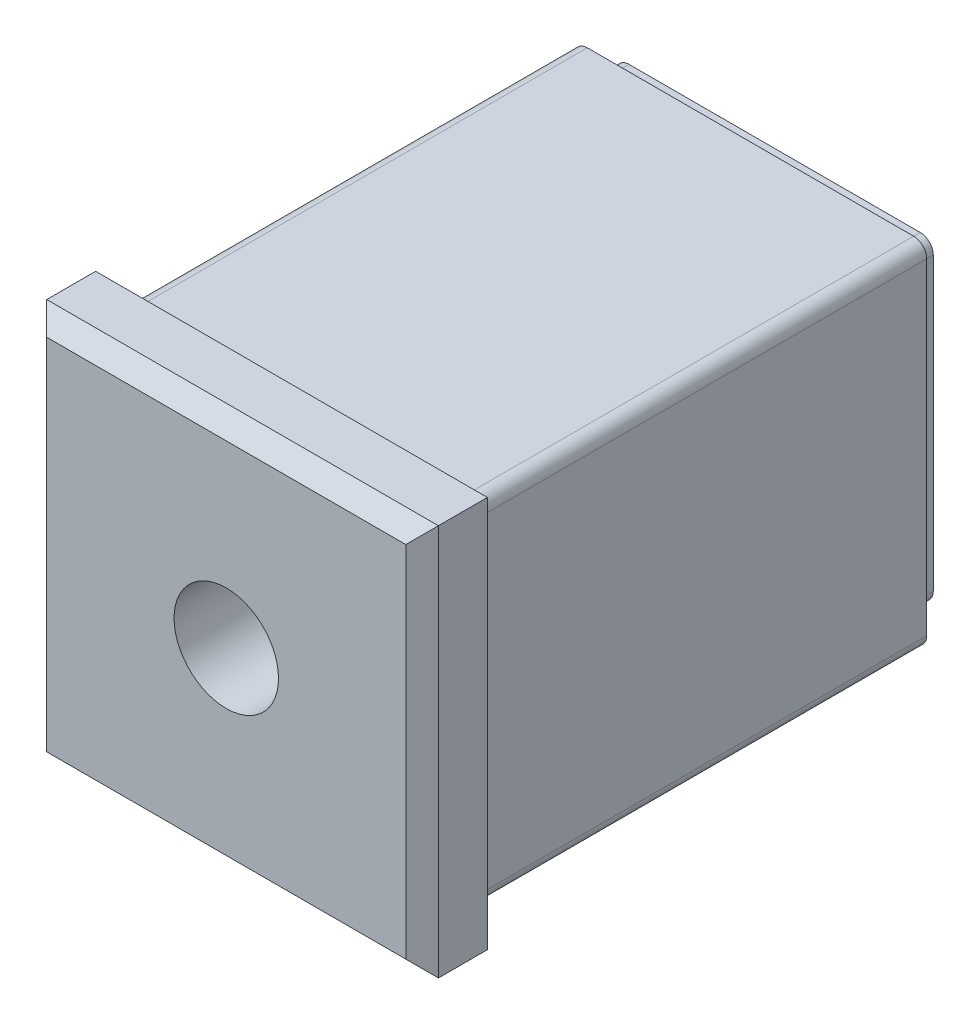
ISO-10303-21;
HEADER;
FILE_DESCRIPTION(('STEP AP214'),'2;1');
FILE_NAME('part.step','',(''),(''),'','','');
FILE_SCHEMA(('AUTOMOTIVE_DESIGN { 1 0 10303 214 1 1 1 1 }'));
ENDSEC;
DATA;
#1=APPLICATION_CONTEXT('core data for automotive mechanical design processes');
#2=APPLICATION_PROTOCOL_DEFINITION('international standard','automotive_design',2000,#1);
#3=PRODUCT_CONTEXT('',#1,'mechanical');
#4=PRODUCT('Part','Part','',(#3));
#5=PRODUCT_RELATED_PRODUCT_CATEGORY('part','',(#4));
#6=PRODUCT_DEFINITION_FORMATION('','',#4);
#7=PRODUCT_DEFINITION_CONTEXT('part definition',#1,'design');
#8=PRODUCT_DEFINITION('design','',#6,#7);
#9=PRODUCT_DEFINITION_SHAPE('','',#8);
#10=(LENGTH_UNIT() NAMED_UNIT(*) SI_UNIT(.MILLI.,.METRE.));
#11=(NAMED_UNIT(*) PLANE_ANGLE_UNIT() SI_UNIT($,.RADIAN.));
#12=(NAMED_UNIT(*) SI_UNIT($,.STERADIAN.) SOLID_ANGLE_UNIT());
#13=UNCERTAINTY_MEASURE_WITH_UNIT(LENGTH_MEASURE(1.E-05),#10,'distance_accuracy_value','');
#14=(GEOMETRIC_REPRESENTATION_CONTEXT(3) GLOBAL_UNCERTAINTY_ASSIGNED_CONTEXT((#13)) GLOBAL_UNIT_ASSIGNED_CONTEXT((#10,
#11,#12)) REPRESENTATION_CONTEXT('',''));
#15=CARTESIAN_POINT('',(0.,0.,0.));
#16=DIRECTION('',(0.,0.,1.));
#17=DIRECTION('',(1.,0.,0.));
#18=AXIS2_PLACEMENT_3D('',#15,#16,#17);
#19=CARTESIAN_POINT('',(13.75,0.,5.));
#20=DIRECTION('',(0.,0.,1.));
#21=DIRECTION('',(0.,1.,0.));
#22=AXIS2_PLACEMENT_3D('',#19,#20,#21);
#23=PLANE('',#22);
#24=DIRECTION('',(0.,-1.,0.));
#25=VECTOR('',#24,1.);
#26=CARTESIAN_POINT('',(-13.75,0.,5.));
#27=LINE('',#26,#25);
#28=CARTESIAN_POINT('',(-13.75,-13.75,5.));
#29=VERTEX_POINT('',#28);
#30=CARTESIAN_POINT('',(-13.75,13.75,5.));
#31=VERTEX_POINT('',#30);
#32=EDGE_CURVE('E237',#29,#31,#27,.F.);
#33=ORIENTED_EDGE('',*,*,#32,.F.);
#34=DIRECTION('',(-1.,0.,0.));
#35=VECTOR('',#34,1.);
#36=CARTESIAN_POINT('',(37.,-13.75,5.));
#37=LINE('',#36,#35);
#38=CARTESIAN_POINT('',(13.75,-13.75,5.));
#39=VERTEX_POINT('',#38);
#40=EDGE_CURVE('E188',#29,#39,#37,.F.);
#41=ORIENTED_EDGE('',*,*,#40,.T.);
#42=DIRECTION('',(0.,-1.,0.));
#43=VECTOR('',#42,1.);
#44=CARTESIAN_POINT('',(13.75,0.,5.));
#45=LINE('',#44,#43);
#46=CARTESIAN_POINT('',(13.75,13.75,5.));
#47=VERTEX_POINT('',#46);
#48=EDGE_CURVE('E347',#47,#39,#45,.T.);
#49=ORIENTED_EDGE('',*,*,#48,.F.);
#50=DIRECTION('',(-1.,0.,0.));
#51=VECTOR('',#50,1.);
#52=CARTESIAN_POINT('',(-30.,13.75,5.));
#53=LINE('',#52,#51);
#54=EDGE_CURVE('E360',#47,#31,#53,.T.);
#55=ORIENTED_EDGE('',*,*,#54,.T.);
#56=EDGE_LOOP('',(#33,#41,#49,#55));
#57=FACE_BOUND('',#56,.T.);
#58=CARTESIAN_POINT('',(0.,0.,5.));
#59=DIRECTION('',(0.,0.,1.));
#60=DIRECTION('',(0.,1.,0.));
#61=AXIS2_PLACEMENT_3D('',#58,#59,#60);
#62=CIRCLE('',#61,4.);
#63=CARTESIAN_POINT('',(0.,4.,5.));
#64=VERTEX_POINT('',#63);
#65=EDGE_CURVE('E191',#64,#64,#62,.F.);
#66=ORIENTED_EDGE('',*,*,#65,.T.);
#67=EDGE_LOOP('',(#66));
#68=FACE_BOUND('',#67,.T.);
#69=ADVANCED_FACE('F14',(#57,#68),#23,.T.);
#70=CARTESIAN_POINT('',(-30.,15.,3.75));
#71=DIRECTION('',(0.,-0.707106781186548,-0.707106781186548));
#72=DIRECTION('',(0.,-0.707106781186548,0.707106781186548));
#73=AXIS2_PLACEMENT_3D('',#70,#71,#72);
#74=PLANE('',#73);
#75=DIRECTION('',(-1.,0.,0.));
#76=VECTOR('',#75,1.);
#77=CARTESIAN_POINT('',(0.,15.,3.75));
#78=LINE('',#77,#76);
#79=CARTESIAN_POINT('',(15.,15.,3.75));
#80=VERTEX_POINT('',#79);
#81=CARTESIAN_POINT('',(-15.,15.,3.75));
#82=VERTEX_POINT('',#81);
#83=EDGE_CURVE('E338',#80,#82,#78,.T.);
#84=ORIENTED_EDGE('',*,*,#83,.T.);
#85=DIRECTION('',(-0.577350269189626,0.577350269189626,-0.577350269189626));
#86=VECTOR('',#85,1.);
#87=CARTESIAN_POINT('',(-13.75,13.75,5.));
#88=LINE('',#87,#86);
#89=EDGE_CURVE('E363',#31,#82,#88,.T.);
#90=ORIENTED_EDGE('',*,*,#89,.F.);
#91=ORIENTED_EDGE('',*,*,#54,.F.);
#92=DIRECTION('',(-0.577350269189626,-0.577350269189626,0.577350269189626));
#93=VECTOR('',#92,1.);
#94=CARTESIAN_POINT('',(15.,15.,3.75));
#95=LINE('',#94,#93);
#96=EDGE_CURVE('E349',#80,#47,#95,.T.);
#97=ORIENTED_EDGE('',*,*,#96,.F.);
#98=EDGE_LOOP('',(#84,#90,#91,#97));
#99=FACE_BOUND('',#98,.T.);
#100=ADVANCED_FACE('F441',(#99),#74,.F.);
#101=CARTESIAN_POINT('',(-13.75,0.,5.));
#102=DIRECTION('',(-0.707106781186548,0.,0.707106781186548));
#103=DIRECTION('',(-0.707106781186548,0.,-0.707106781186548));
#104=AXIS2_PLACEMENT_3D('',#101,#102,#103);
#105=PLANE('',#104);
#106=DIRECTION('',(0.,1.,0.));
#107=VECTOR('',#106,1.);
#108=CARTESIAN_POINT('',(-15.,0.,3.75));
#109=LINE('',#108,#107);
#110=CARTESIAN_POINT('',(-15.,-15.,3.75));
#111=VERTEX_POINT('',#110);
#112=EDGE_CURVE('E18',#111,#82,#109,.T.);
#113=ORIENTED_EDGE('',*,*,#112,.F.);
#114=DIRECTION('',(0.577350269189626,0.577350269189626,0.577350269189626));
#115=VECTOR('',#114,1.);
#116=CARTESIAN_POINT('',(-15.,-15.,3.75));
#117=LINE('',#116,#115);
#118=EDGE_CURVE('E164',#111,#29,#117,.T.);
#119=ORIENTED_EDGE('',*,*,#118,.T.);
#120=ORIENTED_EDGE('',*,*,#32,.T.);
#121=ORIENTED_EDGE('',*,*,#89,.T.);
#122=EDGE_LOOP('',(#113,#119,#120,#121));
#123=FACE_BOUND('',#122,.T.);
#124=ADVANCED_FACE('F443',(#123),#105,.T.);
#125=CARTESIAN_POINT('',(15.,0.,3.75));
#126=DIRECTION('',(0.707106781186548,0.,0.707106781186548));
#127=DIRECTION('',(-0.707106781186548,0.,0.707106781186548));
#128=AXIS2_PLACEMENT_3D('',#125,#126,#127);
#129=PLANE('',#128);
#130=ORIENTED_EDGE('',*,*,#48,.T.);
#131=DIRECTION('',(0.577350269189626,-0.577350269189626,-0.577350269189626));
#132=VECTOR('',#131,1.);
#133=CARTESIAN_POINT('',(13.75,-13.75,5.));
#134=LINE('',#133,#132);
#135=CARTESIAN_POINT('',(15.,-15.,3.75));
#136=VERTEX_POINT('',#135);
#137=EDGE_CURVE('E187',#39,#136,#134,.T.);
#138=ORIENTED_EDGE('',*,*,#137,.T.);
#139=DIRECTION('',(0.,-1.,0.));
#140=VECTOR('',#139,1.);
#141=CARTESIAN_POINT('',(15.,0.,3.75));
#142=LINE('',#141,#140);
#143=EDGE_CURVE('E333',#80,#136,#142,.T.);
#144=ORIENTED_EDGE('',*,*,#143,.F.);
#145=ORIENTED_EDGE('',*,*,#96,.T.);
#146=EDGE_LOOP('',(#130,#138,#144,#145));
#147=FACE_BOUND('',#146,.T.);
#148=ADVANCED_FACE('F446',(#147),#129,.T.);
#149=CARTESIAN_POINT('',(-15.,0.,-37.));
#150=DIRECTION('',(0.,0.,-1.));
#151=DIRECTION('',(0.,-1.,0.));
#152=AXIS2_PLACEMENT_3D('',#149,#150,#151);
#153=PLANE('',#152);
#154=DIRECTION('',(-1.,0.,0.));
#155=VECTOR('',#154,1.);
#156=CARTESIAN_POINT('',(-11.15,12.15,-37.));
#157=LINE('',#156,#155);
#158=CARTESIAN_POINT('',(-11.15,12.15,-37.));
#159=VERTEX_POINT('',#158);
#160=CARTESIAN_POINT('',(11.15,12.15,-37.));
#161=VERTEX_POINT('',#160);
#162=EDGE_CURVE('E322',#159,#161,#157,.F.);
#163=ORIENTED_EDGE('',*,*,#162,.T.);
#164=CARTESIAN_POINT('',(11.15,11.15,-37.));
#165=DIRECTION('',(0.,0.,1.));
#166=DIRECTION('',(0.,1.,0.));
#167=AXIS2_PLACEMENT_3D('',#164,#165,#166);
#168=CIRCLE('',#167,1.);
#169=CARTESIAN_POINT('',(12.15,11.15,-37.));
#170=VERTEX_POINT('',#169);
#171=EDGE_CURVE('E375',#161,#170,#168,.F.);
#172=ORIENTED_EDGE('',*,*,#171,.T.);
#173=DIRECTION('',(0.,1.,0.));
#174=VECTOR('',#173,1.);
#175=CARTESIAN_POINT('',(12.15,11.15,-37.));
#176=LINE('',#175,#174);
#177=CARTESIAN_POINT('',(12.15,-11.15,-37.));
#178=VERTEX_POINT('',#177);
#179=EDGE_CURVE('E327',#170,#178,#176,.F.);
#180=ORIENTED_EDGE('',*,*,#179,.T.);
#181=CARTESIAN_POINT('',(11.15,-11.15,-37.));
#182=DIRECTION('',(0.,0.,1.));
#183=DIRECTION('',(0.,1.,0.));
#184=AXIS2_PLACEMENT_3D('',#181,#182,#183);
#185=CIRCLE('',#184,1.);
#186=CARTESIAN_POINT('',(11.15,-12.15,-37.));
#187=VERTEX_POINT('',#186);
#188=EDGE_CURVE('E211',#178,#187,#185,.F.);
#189=ORIENTED_EDGE('',*,*,#188,.T.);
#190=DIRECTION('',(1.,0.,0.));
#191=VECTOR('',#190,1.);
#192=CARTESIAN_POINT('',(11.15,-12.15,-37.));
#193=LINE('',#192,#191);
#194=CARTESIAN_POINT('',(-11.15,-12.15,-37.));
#195=VERTEX_POINT('',#194);
#196=EDGE_CURVE('E181',#187,#195,#193,.F.);
#197=ORIENTED_EDGE('',*,*,#196,.T.);
#198=CARTESIAN_POINT('',(-11.15,-11.15,-37.));
#199=DIRECTION('',(0.,0.,1.));
#200=DIRECTION('',(0.,1.,0.));
#201=AXIS2_PLACEMENT_3D('',#198,#199,#200);
#202=CIRCLE('',#201,1.);
#203=CARTESIAN_POINT('',(-12.15,-11.15,-37.));
#204=VERTEX_POINT('',#203);
#205=EDGE_CURVE('E193',#195,#204,#202,.F.);
#206=ORIENTED_EDGE('',*,*,#205,.T.);
#207=DIRECTION('',(0.,-1.,0.));
#208=VECTOR('',#207,1.);
#209=CARTESIAN_POINT('',(-12.15,-11.15,-37.));
#210=LINE('',#209,#208);
#211=CARTESIAN_POINT('',(-12.15,11.15,-37.));
#212=VERTEX_POINT('',#211);
#213=EDGE_CURVE('E167',#204,#212,#210,.F.);
#214=ORIENTED_EDGE('',*,*,#213,.T.);
#215=CARTESIAN_POINT('',(-11.15,11.15,-37.));
#216=DIRECTION('',(0.,0.,1.));
#217=DIRECTION('',(0.,1.,0.));
#218=AXIS2_PLACEMENT_3D('',#215,#216,#217);
#219=CIRCLE('',#218,1.);
#220=EDGE_CURVE('E377',#212,#159,#219,.F.);
#221=ORIENTED_EDGE('',*,*,#220,.T.);
#222=EDGE_LOOP('',(#163,#172,#180,#189,#197,#206,#214,#221));
#223=FACE_BOUND('',#222,.T.);
#224=CARTESIAN_POINT('',(0.,0.,-37.));
#225=DIRECTION('',(0.,0.,-1.));
#226=DIRECTION('',(0.,-1.,0.));
#227=AXIS2_PLACEMENT_3D('',#224,#225,#226);
#228=CIRCLE('',#227,4.);
#229=CARTESIAN_POINT('',(0.,-4.,-37.));
#230=VERTEX_POINT('',#229);
#231=EDGE_CURVE('E651',#230,#230,#228,.T.);
#232=ORIENTED_EDGE('',*,*,#231,.F.);
#233=EDGE_LOOP('',(#232));
#234=FACE_BOUND('',#233,.T.);
#235=ADVANCED_FACE('F389',(#223,#234),#153,.T.);
#236=CARTESIAN_POINT('',(15.,0.,-37.));
#237=DIRECTION('',(1.,0.,0.));
#238=DIRECTION('',(0.,-1.,0.));
#239=AXIS2_PLACEMENT_3D('',#236,#237,#238);
#240=PLANE('',#239);
#241=ORIENTED_EDGE('',*,*,#143,.T.);
#242=DIRECTION('',(0.,0.,-1.));
#243=VECTOR('',#242,1.);
#244=CARTESIAN_POINT('',(15.,-15.,5.));
#245=LINE('',#244,#243);
#246=CARTESIAN_POINT('',(15.,-15.,0.));
#247=VERTEX_POINT('',#246);
#248=EDGE_CURVE('E174',#136,#247,#245,.T.);
#249=ORIENTED_EDGE('',*,*,#248,.T.);
#250=DIRECTION('',(0.,-1.,0.));
#251=VECTOR('',#250,1.);
#252=CARTESIAN_POINT('',(15.,0.,0.));
#253=LINE('',#252,#251);
#254=CARTESIAN_POINT('',(15.,15.,0.));
#255=VERTEX_POINT('',#254);
#256=EDGE_CURVE('E309',#255,#247,#253,.T.);
#257=ORIENTED_EDGE('',*,*,#256,.F.);
#258=DIRECTION('',(0.,0.,-1.));
#259=VECTOR('',#258,1.);
#260=CARTESIAN_POINT('',(15.,15.,-37.));
#261=LINE('',#260,#259);
#262=EDGE_CURVE('E337',#255,#80,#261,.F.);
#263=ORIENTED_EDGE('',*,*,#262,.T.);
#264=EDGE_LOOP('',(#241,#249,#257,#263));
#265=FACE_BOUND('',#264,.T.);
#266=ADVANCED_FACE('F467',(#265),#240,.T.);
#267=CARTESIAN_POINT('',(0.,15.,5.));
#268=DIRECTION('',(0.,-1.,0.));
#269=DIRECTION('',(-1.,0.,0.));
#270=AXIS2_PLACEMENT_3D('',#267,#268,#269);
#271=PLANE('',#270);
#272=DIRECTION('',(0.,0.,-1.));
#273=VECTOR('',#272,1.);
#274=CARTESIAN_POINT('',(-15.,15.,5.));
#275=LINE('',#274,#273);
#276=CARTESIAN_POINT('',(-15.,15.,0.));
#277=VERTEX_POINT('',#276);
#278=EDGE_CURVE('E334',#82,#277,#275,.T.);
#279=ORIENTED_EDGE('',*,*,#278,.F.);
#280=ORIENTED_EDGE('',*,*,#83,.F.);
#281=ORIENTED_EDGE('',*,*,#262,.F.);
#282=DIRECTION('',(-1.,0.,0.));
#283=VECTOR('',#282,1.);
#284=CARTESIAN_POINT('',(0.,15.,0.));
#285=LINE('',#284,#283);
#286=EDGE_CURVE('E312',#277,#255,#285,.F.);
#287=ORIENTED_EDGE('',*,*,#286,.F.);
#288=EDGE_LOOP('',(#279,#280,#281,#287));
#289=FACE_BOUND('',#288,.T.);
#290=ADVANCED_FACE('F470',(#289),#271,.F.);
#291=CARTESIAN_POINT('',(-15.,0.,3.75));
#292=DIRECTION('',(-1.,0.,0.));
#293=DIRECTION('',(0.,1.,0.));
#294=AXIS2_PLACEMENT_3D('',#291,#292,#293);
#295=PLANE('',#294);
#296=ORIENTED_EDGE('',*,*,#112,.T.);
#297=ORIENTED_EDGE('',*,*,#278,.T.);
#298=DIRECTION('',(0.,-1.,0.));
#299=VECTOR('',#298,1.);
#300=CARTESIAN_POINT('',(-15.,0.,0.));
#301=LINE('',#300,#299);
#302=CARTESIAN_POINT('',(-15.,-15.,0.));
#303=VERTEX_POINT('',#302);
#304=EDGE_CURVE('E315',#303,#277,#301,.F.);
#305=ORIENTED_EDGE('',*,*,#304,.F.);
#306=DIRECTION('',(0.,0.,-1.));
#307=VECTOR('',#306,1.);
#308=CARTESIAN_POINT('',(-15.,-15.,-37.));
#309=LINE('',#308,#307);
#310=EDGE_CURVE('E169',#303,#111,#309,.F.);
#311=ORIENTED_EDGE('',*,*,#310,.T.);
#312=EDGE_LOOP('',(#296,#297,#305,#311));
#313=FACE_BOUND('',#312,.T.);
#314=ADVANCED_FACE('F474',(#313),#295,.T.);
#315=CARTESIAN_POINT('',(-12.5,13.5,0.));
#316=DIRECTION('',(0.,-1.,0.));
#317=DIRECTION('',(-1.,0.,0.));
#318=AXIS2_PLACEMENT_3D('',#315,#316,#317);
#319=PLANE('',#318);
#320=DIRECTION('',(0.,0.,-1.));
#321=VECTOR('',#320,1.);
#322=CARTESIAN_POINT('',(-12.5,13.5,0.));
#323=LINE('',#322,#321);
#324=CARTESIAN_POINT('',(-12.5,13.5,0.));
#325=VERTEX_POINT('',#324);
#326=CARTESIAN_POINT('',(-12.5,13.5,-35.15));
#327=VERTEX_POINT('',#326);
#328=EDGE_CURVE('E24',#325,#327,#323,.T.);
#329=ORIENTED_EDGE('',*,*,#328,.F.);
#330=DIRECTION('',(-1.,0.,0.));
#331=VECTOR('',#330,1.);
#332=CARTESIAN_POINT('',(-12.5,13.5,0.));
#333=LINE('',#332,#331);
#334=CARTESIAN_POINT('',(12.5,13.5,0.));
#335=VERTEX_POINT('',#334);
#336=EDGE_CURVE('E279',#335,#325,#333,.T.);
#337=ORIENTED_EDGE('',*,*,#336,.F.);
#338=DIRECTION('',(0.,0.,-1.));
#339=VECTOR('',#338,1.);
#340=CARTESIAN_POINT('',(12.5,13.5,0.));
#341=LINE('',#340,#339);
#342=CARTESIAN_POINT('',(12.5,13.5,-35.15));
#343=VERTEX_POINT('',#342);
#344=EDGE_CURVE('E276',#343,#335,#341,.F.);
#345=ORIENTED_EDGE('',*,*,#344,.F.);
#346=DIRECTION('',(-1.,0.,0.));
#347=VECTOR('',#346,1.);
#348=CARTESIAN_POINT('',(-12.5,13.5,-35.15));
#349=LINE('',#348,#347);
#350=EDGE_CURVE('E9',#327,#343,#349,.F.);
#351=ORIENTED_EDGE('',*,*,#350,.F.);
#352=EDGE_LOOP('',(#329,#337,#345,#351));
#353=FACE_BOUND('',#352,.T.);
#354=ADVANCED_FACE('F477',(#353),#319,.F.);
#355=CARTESIAN_POINT('',(-12.5,12.5,0.));
#356=DIRECTION('',(0.,0.,1.));
#357=DIRECTION('',(0.,1.,0.));
#358=AXIS2_PLACEMENT_3D('',#355,#356,#357);
#359=CYLINDRICAL_SURFACE('',#358,1.);
#360=CARTESIAN_POINT('',(-12.5,12.5,0.));
#361=DIRECTION('',(0.,0.,1.));
#362=DIRECTION('',(0.,1.,0.));
#363=AXIS2_PLACEMENT_3D('',#360,#361,#362);
#364=CIRCLE('',#363,1.);
#365=CARTESIAN_POINT('',(-13.5,12.5,0.));
#366=VERTEX_POINT('',#365);
#367=EDGE_CURVE('E295',#366,#325,#364,.F.);
#368=ORIENTED_EDGE('',*,*,#367,.T.);
#369=ORIENTED_EDGE('',*,*,#328,.T.);
#370=CARTESIAN_POINT('',(-12.5,12.5,-35.15));
#371=DIRECTION('',(0.,0.,1.));
#372=DIRECTION('',(0.,1.,0.));
#373=AXIS2_PLACEMENT_3D('',#370,#371,#372);
#374=CIRCLE('',#373,1.);
#375=CARTESIAN_POINT('',(-13.5,12.5,-35.15));
#376=VERTEX_POINT('',#375);
#377=EDGE_CURVE('E32',#376,#327,#374,.F.);
#378=ORIENTED_EDGE('',*,*,#377,.F.);
#379=DIRECTION('',(0.,0.,1.));
#380=VECTOR('',#379,1.);
#381=CARTESIAN_POINT('',(-13.5,12.5,0.));
#382=LINE('',#381,#380);
#383=EDGE_CURVE('E304',#376,#366,#382,.T.);
#384=ORIENTED_EDGE('',*,*,#383,.T.);
#385=EDGE_LOOP('',(#368,#369,#378,#384));
#386=FACE_BOUND('',#385,.T.);
#387=ADVANCED_FACE('F512',(#386),#359,.T.);
#388=CARTESIAN_POINT('',(-13.5,-12.5,0.));
#389=DIRECTION('',(1.,0.,0.));
#390=DIRECTION('',(0.,-1.,0.));
#391=AXIS2_PLACEMENT_3D('',#388,#389,#390);
#392=PLANE('',#391);
#393=DIRECTION('',(0.,-1.,0.));
#394=VECTOR('',#393,1.);
#395=CARTESIAN_POINT('',(-13.5,0.,-35.15));
#396=LINE('',#395,#394);
#397=CARTESIAN_POINT('',(-13.5,-12.5,-35.15));
#398=VERTEX_POINT('',#397);
#399=EDGE_CURVE('E153',#398,#376,#396,.F.);
#400=ORIENTED_EDGE('',*,*,#399,.F.);
#401=DIRECTION('',(0.,0.,1.));
#402=VECTOR('',#401,1.);
#403=CARTESIAN_POINT('',(-13.5,-12.5,0.));
#404=LINE('',#403,#402);
#405=CARTESIAN_POINT('',(-13.5,-12.5,0.));
#406=VERTEX_POINT('',#405);
#407=EDGE_CURVE('E244',#406,#398,#404,.F.);
#408=ORIENTED_EDGE('',*,*,#407,.F.);
#409=DIRECTION('',(0.,-1.,0.));
#410=VECTOR('',#409,1.);
#411=CARTESIAN_POINT('',(-13.5,0.,0.));
#412=LINE('',#411,#410);
#413=EDGE_CURVE('E302',#366,#406,#412,.T.);
#414=ORIENTED_EDGE('',*,*,#413,.F.);
#415=ORIENTED_EDGE('',*,*,#383,.F.);
#416=EDGE_LOOP('',(#400,#408,#414,#415));
#417=FACE_BOUND('',#416,.T.);
#418=ADVANCED_FACE('F405',(#417),#392,.F.);
#419=CARTESIAN_POINT('',(-12.15,-11.15,-35.15));
#420=DIRECTION('',(1.,0.,0.));
#421=DIRECTION('',(0.,-1.,0.));
#422=AXIS2_PLACEMENT_3D('',#419,#420,#421);
#423=PLANE('',#422);
#424=ORIENTED_EDGE('',*,*,#213,.F.);
#425=DIRECTION('',(0.,0.,-1.));
#426=VECTOR('',#425,1.);
#427=CARTESIAN_POINT('',(-12.15,-11.15,-35.15));
#428=LINE('',#427,#426);
#429=CARTESIAN_POINT('',(-12.15,-11.15,-35.15));
#430=VERTEX_POINT('',#429);
#431=EDGE_CURVE('E160',#430,#204,#428,.T.);
#432=ORIENTED_EDGE('',*,*,#431,.F.);
#433=DIRECTION('',(0.,-1.,0.));
#434=VECTOR('',#433,1.);
#435=CARTESIAN_POINT('',(-12.15,0.,-35.15));
#436=LINE('',#435,#434);
#437=CARTESIAN_POINT('',(-12.15,11.15,-35.15));
#438=VERTEX_POINT('',#437);
#439=EDGE_CURVE('E146',#438,#430,#436,.T.);
#440=ORIENTED_EDGE('',*,*,#439,.F.);
#441=DIRECTION('',(0.,0.,-1.));
#442=VECTOR('',#441,1.);
#443=CARTESIAN_POINT('',(-12.15,11.15,-35.15));
#444=LINE('',#443,#442);
#445=EDGE_CURVE('E320',#212,#438,#444,.F.);
#446=ORIENTED_EDGE('',*,*,#445,.F.);
#447=EDGE_LOOP('',(#424,#432,#440,#446));
#448=FACE_BOUND('',#447,.T.);
#449=ADVANCED_FACE('F165',(#448),#423,.F.);
#450=CARTESIAN_POINT('',(-11.15,11.15,-35.15));
#451=DIRECTION('',(0.,0.,1.));
#452=DIRECTION('',(0.,1.,0.));
#453=AXIS2_PLACEMENT_3D('',#450,#451,#452);
#454=CYLINDRICAL_SURFACE('',#453,1.);
#455=CARTESIAN_POINT('',(-11.15,11.15,-35.15));
#456=DIRECTION('',(0.,0.,1.));
#457=DIRECTION('',(0.,1.,0.));
#458=AXIS2_PLACEMENT_3D('',#455,#456,#457);
#459=CIRCLE('',#458,1.);
#460=CARTESIAN_POINT('',(-11.15,12.15,-35.15));
#461=VERTEX_POINT('',#460);
#462=EDGE_CURVE('E149',#438,#461,#459,.F.);
#463=ORIENTED_EDGE('',*,*,#462,.T.);
#464=DIRECTION('',(0.,0.,-1.));
#465=VECTOR('',#464,1.);
#466=CARTESIAN_POINT('',(-11.15,12.15,-35.15));
#467=LINE('',#466,#465);
#468=EDGE_CURVE('E326',#461,#159,#467,.T.);
#469=ORIENTED_EDGE('',*,*,#468,.T.);
#470=ORIENTED_EDGE('',*,*,#220,.F.);
#471=ORIENTED_EDGE('',*,*,#445,.T.);
#472=EDGE_LOOP('',(#463,#469,#470,#471));
#473=FACE_BOUND('',#472,.T.);
#474=ADVANCED_FACE('F395',(#473),#454,.T.);
#475=CARTESIAN_POINT('',(-11.15,12.15,-35.15));
#476=DIRECTION('',(0.,-1.,0.));
#477=DIRECTION('',(-1.,0.,0.));
#478=AXIS2_PLACEMENT_3D('',#475,#476,#477);
#479=PLANE('',#478);
#480=ORIENTED_EDGE('',*,*,#468,.F.);
#481=DIRECTION('',(-1.,0.,0.));
#482=VECTOR('',#481,1.);
#483=CARTESIAN_POINT('',(0.,12.15,-35.15));
#484=LINE('',#483,#482);
#485=CARTESIAN_POINT('',(11.15,12.15,-35.15));
#486=VERTEX_POINT('',#485);
#487=EDGE_CURVE('E154',#486,#461,#484,.T.);
#488=ORIENTED_EDGE('',*,*,#487,.F.);
#489=DIRECTION('',(0.,0.,-1.));
#490=VECTOR('',#489,1.);
#491=CARTESIAN_POINT('',(11.15,12.15,-35.15));
#492=LINE('',#491,#490);
#493=EDGE_CURVE('E323',#161,#486,#492,.F.);
#494=ORIENTED_EDGE('',*,*,#493,.F.);
#495=ORIENTED_EDGE('',*,*,#162,.F.);
#496=EDGE_LOOP('',(#480,#488,#494,#495));
#497=FACE_BOUND('',#496,.T.);
#498=ADVANCED_FACE('F394',(#497),#479,.F.);
#499=CARTESIAN_POINT('',(11.15,11.15,-35.15));
#500=DIRECTION('',(0.,0.,1.));
#501=DIRECTION('',(0.,1.,0.));
#502=AXIS2_PLACEMENT_3D('',#499,#500,#501);
#503=CYLINDRICAL_SURFACE('',#502,1.);
#504=CARTESIAN_POINT('',(11.15,11.15,-35.15));
#505=DIRECTION('',(0.,0.,1.));
#506=DIRECTION('',(0.,1.,0.));
#507=AXIS2_PLACEMENT_3D('',#504,#505,#506);
#508=CIRCLE('',#507,1.);
#509=CARTESIAN_POINT('',(12.15,11.15,-35.15));
#510=VERTEX_POINT('',#509);
#511=EDGE_CURVE('E228',#486,#510,#508,.F.);
#512=ORIENTED_EDGE('',*,*,#511,.T.);
#513=DIRECTION('',(0.,0.,-1.));
#514=VECTOR('',#513,1.);
#515=CARTESIAN_POINT('',(12.15,11.15,-35.15));
#516=LINE('',#515,#514);
#517=EDGE_CURVE('E330',#510,#170,#516,.T.);
#518=ORIENTED_EDGE('',*,*,#517,.T.);
#519=ORIENTED_EDGE('',*,*,#171,.F.);
#520=ORIENTED_EDGE('',*,*,#493,.T.);
#521=EDGE_LOOP('',(#512,#518,#519,#520));
#522=FACE_BOUND('',#521,.T.);
#523=ADVANCED_FACE('F382',(#522),#503,.T.);
#524=CARTESIAN_POINT('',(12.15,11.15,-35.15));
#525=DIRECTION('',(-1.,0.,0.));
#526=DIRECTION('',(0.,1.,0.));
#527=AXIS2_PLACEMENT_3D('',#524,#525,#526);
#528=PLANE('',#527);
#529=ORIENTED_EDGE('',*,*,#517,.F.);
#530=DIRECTION('',(0.,-1.,0.));
#531=VECTOR('',#530,1.);
#532=CARTESIAN_POINT('',(12.15,0.,-35.15));
#533=LINE('',#532,#531);
#534=CARTESIAN_POINT('',(12.15,-11.15,-35.15));
#535=VERTEX_POINT('',#534);
#536=EDGE_CURVE('E293',#535,#510,#533,.F.);
#537=ORIENTED_EDGE('',*,*,#536,.F.);
#538=DIRECTION('',(0.,0.,-1.));
#539=VECTOR('',#538,1.);
#540=CARTESIAN_POINT('',(12.15,-11.15,-35.15));
#541=LINE('',#540,#539);
#542=EDGE_CURVE('E184',#178,#535,#541,.F.);
#543=ORIENTED_EDGE('',*,*,#542,.F.);
#544=ORIENTED_EDGE('',*,*,#179,.F.);
#545=EDGE_LOOP('',(#529,#537,#543,#544));
#546=FACE_BOUND('',#545,.T.);
#547=ADVANCED_FACE('F387',(#546),#528,.F.);
#548=CARTESIAN_POINT('',(13.5,12.5,0.));
#549=DIRECTION('',(-1.,0.,0.));
#550=DIRECTION('',(0.,1.,0.));
#551=AXIS2_PLACEMENT_3D('',#548,#549,#550);
#552=PLANE('',#551);
#553=DIRECTION('',(0.,0.,1.));
#554=VECTOR('',#553,1.);
#555=CARTESIAN_POINT('',(13.5,12.5,0.));
#556=LINE('',#555,#554);
#557=CARTESIAN_POINT('',(13.5,12.5,0.));
#558=VERTEX_POINT('',#557);
#559=CARTESIAN_POINT('',(13.5,12.5,-35.15));
#560=VERTEX_POINT('',#559);
#561=EDGE_CURVE('E316',#558,#560,#556,.F.);
#562=ORIENTED_EDGE('',*,*,#561,.F.);
#563=DIRECTION('',(0.,-1.,0.));
#564=VECTOR('',#563,1.);
#565=CARTESIAN_POINT('',(13.5,0.,0.));
#566=LINE('',#565,#564);
#567=CARTESIAN_POINT('',(13.5,-12.5,0.));
#568=VERTEX_POINT('',#567);
#569=EDGE_CURVE('E260',#568,#558,#566,.F.);
#570=ORIENTED_EDGE('',*,*,#569,.F.);
#571=DIRECTION('',(0.,0.,1.));
#572=VECTOR('',#571,1.);
#573=CARTESIAN_POINT('',(13.5,-12.5,0.));
#574=LINE('',#573,#572);
#575=CARTESIAN_POINT('',(13.5,-12.5,-35.15));
#576=VERTEX_POINT('',#575);
#577=EDGE_CURVE('E206',#576,#568,#574,.T.);
#578=ORIENTED_EDGE('',*,*,#577,.F.);
#579=DIRECTION('',(0.,-1.,0.));
#580=VECTOR('',#579,1.);
#581=CARTESIAN_POINT('',(13.5,0.,-35.15));
#582=LINE('',#581,#580);
#583=EDGE_CURVE('E272',#560,#576,#582,.T.);
#584=ORIENTED_EDGE('',*,*,#583,.F.);
#585=EDGE_LOOP('',(#562,#570,#578,#584));
#586=FACE_BOUND('',#585,.T.);
#587=ADVANCED_FACE('F458',(#586),#552,.F.);
#588=CARTESIAN_POINT('',(12.5,12.5,0.));
#589=DIRECTION('',(0.,0.,1.));
#590=DIRECTION('',(0.,1.,0.));
#591=AXIS2_PLACEMENT_3D('',#588,#589,#590);
#592=CYLINDRICAL_SURFACE('',#591,1.);
#593=CARTESIAN_POINT('',(12.5,12.5,0.));
#594=DIRECTION('',(0.,0.,1.));
#595=DIRECTION('',(0.,1.,0.));
#596=AXIS2_PLACEMENT_3D('',#593,#594,#595);
#597=CIRCLE('',#596,1.);
#598=EDGE_CURVE('E305',#558,#335,#597,.T.);
#599=ORIENTED_EDGE('',*,*,#598,.F.);
#600=ORIENTED_EDGE('',*,*,#561,.T.);
#601=CARTESIAN_POINT('',(12.5,12.5,-35.15));
#602=DIRECTION('',(0.,0.,1.));
#603=DIRECTION('',(0.,1.,0.));
#604=AXIS2_PLACEMENT_3D('',#601,#602,#603);
#605=CIRCLE('',#604,1.);
#606=EDGE_CURVE('E275',#343,#560,#605,.F.);
#607=ORIENTED_EDGE('',*,*,#606,.F.);
#608=ORIENTED_EDGE('',*,*,#344,.T.);
#609=EDGE_LOOP('',(#599,#600,#607,#608));
#610=FACE_BOUND('',#609,.T.);
#611=ADVANCED_FACE('F464',(#610),#592,.T.);
#612=CARTESIAN_POINT('',(0.,0.,-35.15));
#613=DIRECTION('',(0.,0.,-1.));
#614=DIRECTION('',(0.,-1.,0.));
#615=AXIS2_PLACEMENT_3D('',#612,#613,#614);
#616=PLANE('',#615);
#617=ORIENTED_EDGE('',*,*,#439,.T.);
#618=CARTESIAN_POINT('',(-11.15,-11.15,-35.15));
#619=DIRECTION('',(0.,0.,1.));
#620=DIRECTION('',(0.,1.,0.));
#621=AXIS2_PLACEMENT_3D('',#618,#619,#620);
#622=CIRCLE('',#621,1.);
#623=CARTESIAN_POINT('',(-11.15,-12.15,-35.15));
#624=VERTEX_POINT('',#623);
#625=EDGE_CURVE('E143',#624,#430,#622,.F.);
#626=ORIENTED_EDGE('',*,*,#625,.F.);
#627=DIRECTION('',(-1.,0.,0.));
#628=VECTOR('',#627,1.);
#629=CARTESIAN_POINT('',(0.,-12.15,-35.15));
#630=LINE('',#629,#628);
#631=CARTESIAN_POINT('',(11.15,-12.15,-35.15));
#632=VERTEX_POINT('',#631);
#633=EDGE_CURVE('E203',#624,#632,#630,.F.);
#634=ORIENTED_EDGE('',*,*,#633,.T.);
#635=CARTESIAN_POINT('',(11.15,-11.15,-35.15));
#636=DIRECTION('',(0.,0.,1.));
#637=DIRECTION('',(0.,1.,0.));
#638=AXIS2_PLACEMENT_3D('',#635,#636,#637);
#639=CIRCLE('',#638,1.);
#640=EDGE_CURVE('E163',#535,#632,#639,.F.);
#641=ORIENTED_EDGE('',*,*,#640,.F.);
#642=ORIENTED_EDGE('',*,*,#536,.T.);
#643=ORIENTED_EDGE('',*,*,#511,.F.);
#644=ORIENTED_EDGE('',*,*,#487,.T.);
#645=ORIENTED_EDGE('',*,*,#462,.F.);
#646=EDGE_LOOP('',(#617,#626,#634,#641,#642,#643,#644,#645));
#647=FACE_BOUND('',#646,.T.);
#648=ORIENTED_EDGE('',*,*,#606,.T.);
#649=ORIENTED_EDGE('',*,*,#583,.T.);
#650=CARTESIAN_POINT('',(12.5,-12.5,-35.15));
#651=DIRECTION('',(0.,0.,1.));
#652=DIRECTION('',(0.,1.,0.));
#653=AXIS2_PLACEMENT_3D('',#650,#651,#652);
#654=CIRCLE('',#653,1.);
#655=CARTESIAN_POINT('',(12.5,-13.5,-35.15));
#656=VERTEX_POINT('',#655);
#657=EDGE_CURVE('E201',#576,#656,#654,.F.);
#658=ORIENTED_EDGE('',*,*,#657,.T.);
#659=DIRECTION('',(1.,0.,0.));
#660=VECTOR('',#659,1.);
#661=CARTESIAN_POINT('',(12.5,-13.5,-35.15));
#662=LINE('',#661,#660);
#663=CARTESIAN_POINT('',(-12.5,-13.5,-35.15));
#664=VERTEX_POINT('',#663);
#665=EDGE_CURVE('E233',#656,#664,#662,.F.);
#666=ORIENTED_EDGE('',*,*,#665,.T.);
#667=CARTESIAN_POINT('',(-12.5,-12.5,-35.15));
#668=DIRECTION('',(0.,0.,1.));
#669=DIRECTION('',(0.,1.,0.));
#670=AXIS2_PLACEMENT_3D('',#667,#668,#669);
#671=CIRCLE('',#670,1.);
#672=EDGE_CURVE('E197',#664,#398,#671,.F.);
#673=ORIENTED_EDGE('',*,*,#672,.T.);
#674=ORIENTED_EDGE('',*,*,#399,.T.);
#675=ORIENTED_EDGE('',*,*,#377,.T.);
#676=ORIENTED_EDGE('',*,*,#350,.T.);
#677=EDGE_LOOP('',(#648,#649,#658,#666,#673,#674,#675,#676));
#678=FACE_BOUND('',#677,.T.);
#679=ADVANCED_FACE('F147',(#647,#678),#616,.T.);
#680=CARTESIAN_POINT('',(0.,0.,0.));
#681=DIRECTION('',(0.,0.,-1.));
#682=DIRECTION('',(0.,-1.,0.));
#683=AXIS2_PLACEMENT_3D('',#680,#681,#682);
#684=PLANE('',#683);
#685=ORIENTED_EDGE('',*,*,#413,.T.);
#686=CARTESIAN_POINT('',(-12.5,-12.5,0.));
#687=DIRECTION('',(0.,0.,1.));
#688=DIRECTION('',(0.,1.,0.));
#689=AXIS2_PLACEMENT_3D('',#686,#687,#688);
#690=CIRCLE('',#689,1.);
#691=CARTESIAN_POINT('',(-12.5,-13.5,0.));
#692=VERTEX_POINT('',#691);
#693=EDGE_CURVE('E207',#406,#692,#690,.T.);
#694=ORIENTED_EDGE('',*,*,#693,.T.);
#695=DIRECTION('',(1.,0.,0.));
#696=VECTOR('',#695,1.);
#697=CARTESIAN_POINT('',(12.5,-13.5,0.));
#698=LINE('',#697,#696);
#699=CARTESIAN_POINT('',(12.5,-13.5,0.));
#700=VERTEX_POINT('',#699);
#701=EDGE_CURVE('E234',#692,#700,#698,.T.);
#702=ORIENTED_EDGE('',*,*,#701,.T.);
#703=CARTESIAN_POINT('',(12.5,-12.5,0.));
#704=DIRECTION('',(0.,0.,1.));
#705=DIRECTION('',(0.,1.,0.));
#706=AXIS2_PLACEMENT_3D('',#703,#704,#705);
#707=CIRCLE('',#706,1.);
#708=EDGE_CURVE('E204',#568,#700,#707,.F.);
#709=ORIENTED_EDGE('',*,*,#708,.F.);
#710=ORIENTED_EDGE('',*,*,#569,.T.);
#711=ORIENTED_EDGE('',*,*,#598,.T.);
#712=ORIENTED_EDGE('',*,*,#336,.T.);
#713=ORIENTED_EDGE('',*,*,#367,.F.);
#714=EDGE_LOOP('',(#685,#694,#702,#709,#710,#711,#712,#713));
#715=FACE_BOUND('',#714,.T.);
#716=DIRECTION('',(-1.,0.,0.));
#717=VECTOR('',#716,1.);
#718=CARTESIAN_POINT('',(0.,-15.,0.));
#719=LINE('',#718,#717);
#720=EDGE_CURVE('E209',#247,#303,#719,.T.);
#721=ORIENTED_EDGE('',*,*,#720,.T.);
#722=ORIENTED_EDGE('',*,*,#304,.T.);
#723=ORIENTED_EDGE('',*,*,#286,.T.);
#724=ORIENTED_EDGE('',*,*,#256,.T.);
#725=EDGE_LOOP('',(#721,#722,#723,#724));
#726=FACE_BOUND('',#725,.T.);
#727=ADVANCED_FACE('F258',(#715,#726),#684,.T.);
#728=CARTESIAN_POINT('',(37.,-15.,3.75));
#729=DIRECTION('',(0.,0.707106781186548,-0.707106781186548));
#730=DIRECTION('',(0.,-0.707106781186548,-0.707106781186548));
#731=AXIS2_PLACEMENT_3D('',#728,#729,#730);
#732=PLANE('',#731);
#733=DIRECTION('',(1.,0.,0.));
#734=VECTOR('',#733,1.);
#735=CARTESIAN_POINT('',(0.,-15.,3.75));
#736=LINE('',#735,#734);
#737=EDGE_CURVE('E180',#111,#136,#736,.T.);
#738=ORIENTED_EDGE('',*,*,#737,.T.);
#739=ORIENTED_EDGE('',*,*,#137,.F.);
#740=ORIENTED_EDGE('',*,*,#40,.F.);
#741=ORIENTED_EDGE('',*,*,#118,.F.);
#742=EDGE_LOOP('',(#738,#739,#740,#741));
#743=FACE_BOUND('',#742,.T.);
#744=ADVANCED_FACE('F16',(#743),#732,.F.);
#745=CARTESIAN_POINT('',(0.,-15.,5.));
#746=DIRECTION('',(0.,1.,0.));
#747=DIRECTION('',(1.,0.,0.));
#748=AXIS2_PLACEMENT_3D('',#745,#746,#747);
#749=PLANE('',#748);
#750=ORIENTED_EDGE('',*,*,#248,.F.);
#751=ORIENTED_EDGE('',*,*,#737,.F.);
#752=ORIENTED_EDGE('',*,*,#310,.F.);
#753=ORIENTED_EDGE('',*,*,#720,.F.);
#754=EDGE_LOOP('',(#750,#751,#752,#753));
#755=FACE_BOUND('',#754,.T.);
#756=ADVANCED_FACE('F410',(#755),#749,.F.);
#757=CARTESIAN_POINT('',(12.5,-13.5,0.));
#758=DIRECTION('',(0.,1.,0.));
#759=DIRECTION('',(1.,0.,0.));
#760=AXIS2_PLACEMENT_3D('',#757,#758,#759);
#761=PLANE('',#760);
#762=DIRECTION('',(0.,0.,-1.));
#763=VECTOR('',#762,1.);
#764=CARTESIAN_POINT('',(12.5,-13.5,0.));
#765=LINE('',#764,#763);
#766=EDGE_CURVE('E230',#700,#656,#765,.T.);
#767=ORIENTED_EDGE('',*,*,#766,.F.);
#768=ORIENTED_EDGE('',*,*,#701,.F.);
#769=DIRECTION('',(0.,0.,-1.));
#770=VECTOR('',#769,1.);
#771=CARTESIAN_POINT('',(-12.5,-13.5,0.));
#772=LINE('',#771,#770);
#773=EDGE_CURVE('E200',#664,#692,#772,.F.);
#774=ORIENTED_EDGE('',*,*,#773,.F.);
#775=ORIENTED_EDGE('',*,*,#665,.F.);
#776=EDGE_LOOP('',(#767,#768,#774,#775));
#777=FACE_BOUND('',#776,.T.);
#778=ADVANCED_FACE('F265',(#777),#761,.F.);
#779=CARTESIAN_POINT('',(12.5,-12.5,0.));
#780=DIRECTION('',(0.,0.,1.));
#781=DIRECTION('',(0.,1.,0.));
#782=AXIS2_PLACEMENT_3D('',#779,#780,#781);
#783=CYLINDRICAL_SURFACE('',#782,1.);
#784=ORIENTED_EDGE('',*,*,#708,.T.);
#785=ORIENTED_EDGE('',*,*,#766,.T.);
#786=ORIENTED_EDGE('',*,*,#657,.F.);
#787=ORIENTED_EDGE('',*,*,#577,.T.);
#788=EDGE_LOOP('',(#784,#785,#786,#787));
#789=FACE_BOUND('',#788,.T.);
#790=ADVANCED_FACE('F253',(#789),#783,.T.);
#791=CARTESIAN_POINT('',(11.15,-11.15,-35.15));
#792=DIRECTION('',(0.,0.,1.));
#793=DIRECTION('',(0.,1.,0.));
#794=AXIS2_PLACEMENT_3D('',#791,#792,#793);
#795=CYLINDRICAL_SURFACE('',#794,1.);
#796=ORIENTED_EDGE('',*,*,#640,.T.);
#797=DIRECTION('',(0.,0.,-1.));
#798=VECTOR('',#797,1.);
#799=CARTESIAN_POINT('',(11.15,-12.15,-35.15));
#800=LINE('',#799,#798);
#801=EDGE_CURVE('E171',#632,#187,#800,.T.);
#802=ORIENTED_EDGE('',*,*,#801,.T.);
#803=ORIENTED_EDGE('',*,*,#188,.F.);
#804=ORIENTED_EDGE('',*,*,#542,.T.);
#805=EDGE_LOOP('',(#796,#802,#803,#804));
#806=FACE_BOUND('',#805,.T.);
#807=ADVANCED_FACE('F218',(#806),#795,.T.);
#808=CARTESIAN_POINT('',(11.15,-12.15,-35.15));
#809=DIRECTION('',(0.,1.,0.));
#810=DIRECTION('',(1.,0.,0.));
#811=AXIS2_PLACEMENT_3D('',#808,#809,#810);
#812=PLANE('',#811);
#813=ORIENTED_EDGE('',*,*,#801,.F.);
#814=ORIENTED_EDGE('',*,*,#633,.F.);
#815=DIRECTION('',(0.,0.,-1.));
#816=VECTOR('',#815,1.);
#817=CARTESIAN_POINT('',(-11.15,-12.15,-35.15));
#818=LINE('',#817,#816);
#819=EDGE_CURVE('E161',#195,#624,#818,.F.);
#820=ORIENTED_EDGE('',*,*,#819,.F.);
#821=ORIENTED_EDGE('',*,*,#196,.F.);
#822=EDGE_LOOP('',(#813,#814,#820,#821));
#823=FACE_BOUND('',#822,.T.);
#824=ADVANCED_FACE('F224',(#823),#812,.F.);
#825=CARTESIAN_POINT('',(-11.15,-11.15,-35.15));
#826=DIRECTION('',(0.,0.,1.));
#827=DIRECTION('',(0.,1.,0.));
#828=AXIS2_PLACEMENT_3D('',#825,#826,#827);
#829=CYLINDRICAL_SURFACE('',#828,1.);
#830=ORIENTED_EDGE('',*,*,#625,.T.);
#831=ORIENTED_EDGE('',*,*,#431,.T.);
#832=ORIENTED_EDGE('',*,*,#205,.F.);
#833=ORIENTED_EDGE('',*,*,#819,.T.);
#834=EDGE_LOOP('',(#830,#831,#832,#833));
#835=FACE_BOUND('',#834,.T.);
#836=ADVANCED_FACE('F158',(#835),#829,.T.);
#837=CARTESIAN_POINT('',(-12.5,-12.5,0.));
#838=DIRECTION('',(0.,0.,1.));
#839=DIRECTION('',(0.,1.,0.));
#840=AXIS2_PLACEMENT_3D('',#837,#838,#839);
#841=CYLINDRICAL_SURFACE('',#840,1.);
#842=ORIENTED_EDGE('',*,*,#693,.F.);
#843=ORIENTED_EDGE('',*,*,#407,.T.);
#844=ORIENTED_EDGE('',*,*,#672,.F.);
#845=ORIENTED_EDGE('',*,*,#773,.T.);
#846=EDGE_LOOP('',(#842,#843,#844,#845));
#847=FACE_BOUND('',#846,.T.);
#848=ADVANCED_FACE('F269',(#847),#841,.T.);
#849=CARTESIAN_POINT('',(0.,0.,34.5130191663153));
#850=DIRECTION('',(0.,0.,-1.));
#851=DIRECTION('',(0.,-1.,0.));
#852=AXIS2_PLACEMENT_3D('',#849,#850,#851);
#853=CYLINDRICAL_SURFACE('',#852,4.);
#854=ORIENTED_EDGE('',*,*,#231,.T.);
#855=EDGE_LOOP('',(#854));
#856=FACE_BOUND('',#855,.T.);
#857=ORIENTED_EDGE('',*,*,#65,.F.);
#858=EDGE_LOOP('',(#857));
#859=FACE_BOUND('',#858,.T.);
#860=ADVANCED_FACE('F420',(#856,#859),#853,.F.);
#861=CLOSED_SHELL('',(#69,#100,#124,#148,#235,#266,#290,#314,#354,#387,#418,#449,#474,#498,#523,
#547,#587,#611,#679,#727,#744,#756,#778,#790,#807,#824,#836,#848,#860));
#862=MANIFOLD_SOLID_BREP('B1',#861);
#863=ADVANCED_BREP_SHAPE_REPRESENTATION('',(#18,#862),#14);
#864=SHAPE_DEFINITION_REPRESENTATION(#9,#863);
ENDSEC;
END-ISO-10303-21;
